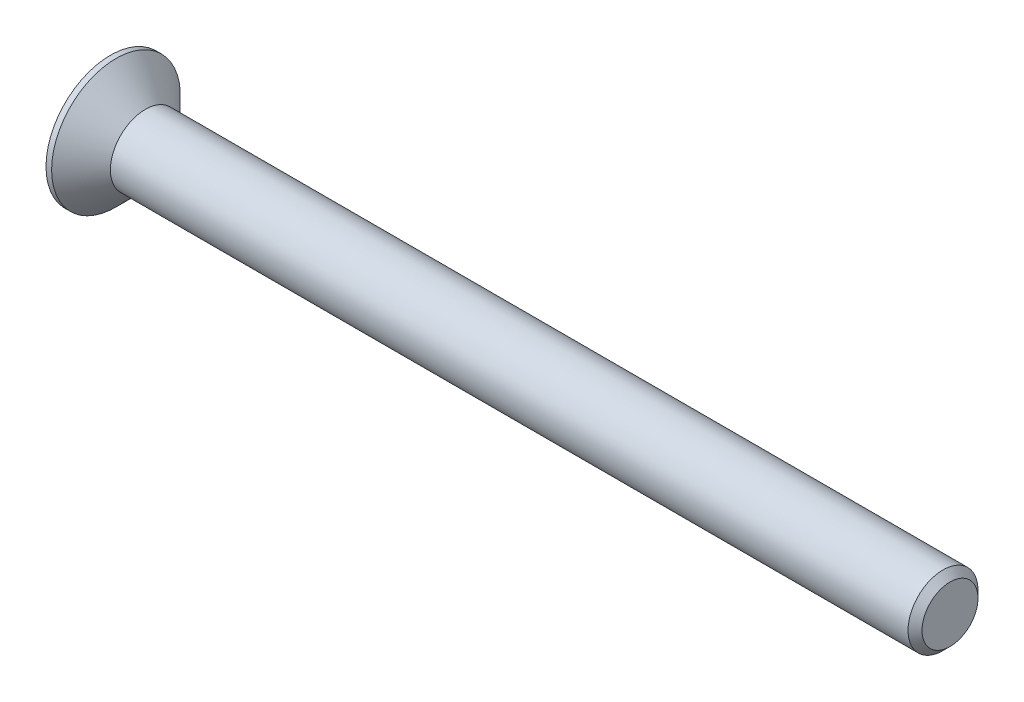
from build123d import *

# Parameters (mm, degrees)
CHAMFER1_SIZE      = 0.5
CUT_EXTRUDE1_DEPTH = 2.1


with BuildPart() as part:
    # Sketch1 → Revolve1 (revolve)
    with BuildSketch(Plane.XY, mode=Mode.PRIVATE) as revolve1_sk:
        Polygon((-2.5, 4.6), (-2.5, 0), (57.5, 0), (57.5, 2.5), (0, 2.5), (-2.1, 4.6), align=None)
    revolve(revolve1_sk.sketch.rotate(Axis((-2.5, 0, 0), (1, 0, 0)), 90), axis=Axis((-2.5, 0, 0), (1, 0, 0)))

    # Chamfer1
    chamfer1_edges = [part.edges().sort_by_distance(p)[0] for p in [
        (57.5, 0, -2.5),
    ]]
    chamfer(chamfer1_edges, length=CHAMFER1_SIZE)

    # Sketch2 → Cut-Extrude1 (cut)
    with BuildSketch(Plane.ZY.offset(2.5)):
        Polygon((-0.575, 2.3), (0.575, 2.3), (0.575, 0.575), (2.3, 0.575), (2.3, -0.575), (0.575, -0.575), (0.575, -2.3), (-0.575, -2.3), (-0.575, -0.575), (-2.3, -0.575), (-2.3, 0.575), (-0.575, 0.575), align=None)
    extrude(amount=-CUT_EXTRUDE1_DEPTH, mode=Mode.SUBTRACT)


solid = part.part
